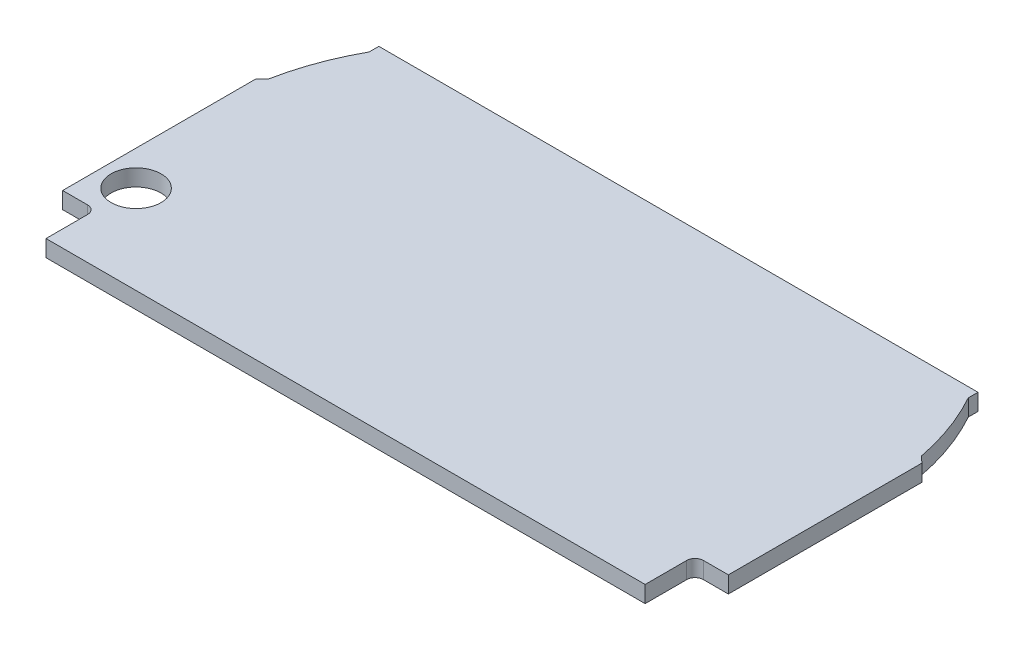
ISO-10303-21;
HEADER;
FILE_DESCRIPTION(('STEP AP214'),'2;1');
FILE_NAME('part.step','',(''),(''),'','','');
FILE_SCHEMA(('AUTOMOTIVE_DESIGN { 1 0 10303 214 1 1 1 1 }'));
ENDSEC;
DATA;
#1=APPLICATION_CONTEXT('core data for automotive mechanical design processes');
#2=APPLICATION_PROTOCOL_DEFINITION('international standard','automotive_design',2000,#1);
#3=PRODUCT_CONTEXT('',#1,'mechanical');
#4=PRODUCT('Part','Part','',(#3));
#5=PRODUCT_RELATED_PRODUCT_CATEGORY('part','',(#4));
#6=PRODUCT_DEFINITION_FORMATION('','',#4);
#7=PRODUCT_DEFINITION_CONTEXT('part definition',#1,'design');
#8=PRODUCT_DEFINITION('design','',#6,#7);
#9=PRODUCT_DEFINITION_SHAPE('','',#8);
#10=(LENGTH_UNIT() NAMED_UNIT(*) SI_UNIT(.MILLI.,.METRE.));
#11=(NAMED_UNIT(*) PLANE_ANGLE_UNIT() SI_UNIT($,.RADIAN.));
#12=(NAMED_UNIT(*) SI_UNIT($,.STERADIAN.) SOLID_ANGLE_UNIT());
#13=UNCERTAINTY_MEASURE_WITH_UNIT(LENGTH_MEASURE(1.E-05),#10,'distance_accuracy_value','');
#14=(GEOMETRIC_REPRESENTATION_CONTEXT(3) GLOBAL_UNCERTAINTY_ASSIGNED_CONTEXT((#13)) GLOBAL_UNIT_ASSIGNED_CONTEXT((#10,
#11,#12)) REPRESENTATION_CONTEXT('',''));
#15=CARTESIAN_POINT('',(0.,0.,0.));
#16=DIRECTION('',(0.,0.,1.));
#17=DIRECTION('',(1.,0.,0.));
#18=AXIS2_PLACEMENT_3D('',#15,#16,#17);
#19=CARTESIAN_POINT('',(19.5581651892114,1.,-30.2431440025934));
#20=DIRECTION('',(0.,-1.,0.));
#21=DIRECTION('',(0.,0.,-1.));
#22=AXIS2_PLACEMENT_3D('',#19,#20,#21);
#23=CYLINDRICAL_SURFACE('',#22,15.);
#24=CARTESIAN_POINT('',(19.5581651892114,0.,-30.2431440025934));
#25=DIRECTION('',(0.,1.,0.));
#26=DIRECTION('',(0.,0.,1.));
#27=AXIS2_PLACEMENT_3D('',#24,#25,#26);
#28=CIRCLE('',#27,15.);
#29=CARTESIAN_POINT('',(4.83663293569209,0.,-33.1200326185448));
#30=VERTEX_POINT('',#29);
#31=CARTESIAN_POINT('',(6.45015274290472,0.,-37.5356065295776));
#32=VERTEX_POINT('',#31);
#33=EDGE_CURVE('E168',#30,#32,#28,.F.);
#34=ORIENTED_EDGE('',*,*,#33,.F.);
#35=DIRECTION('',(0.,-1.,0.));
#36=VECTOR('',#35,1.);
#37=CARTESIAN_POINT('',(4.83663293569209,1.,-33.1200326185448));
#38=LINE('',#37,#36);
#39=CARTESIAN_POINT('',(4.83663293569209,1.,-33.1200326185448));
#40=VERTEX_POINT('',#39);
#41=EDGE_CURVE('E11',#40,#30,#38,.T.);
#42=ORIENTED_EDGE('',*,*,#41,.F.);
#43=CARTESIAN_POINT('',(19.5581651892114,1.,-30.2431440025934));
#44=DIRECTION('',(0.,1.,0.));
#45=DIRECTION('',(0.,0.,1.));
#46=AXIS2_PLACEMENT_3D('',#43,#44,#45);
#47=CIRCLE('',#46,15.);
#48=CARTESIAN_POINT('',(6.45015274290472,1.,-37.5356065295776));
#49=VERTEX_POINT('',#48);
#50=EDGE_CURVE('E228',#40,#49,#47,.F.);
#51=ORIENTED_EDGE('',*,*,#50,.T.);
#52=DIRECTION('',(0.,-1.,0.));
#53=VECTOR('',#52,1.);
#54=CARTESIAN_POINT('',(6.45015274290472,1.,-37.5356065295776));
#55=LINE('',#54,#53);
#56=EDGE_CURVE('E92',#49,#32,#55,.T.);
#57=ORIENTED_EDGE('',*,*,#56,.T.);
#58=EDGE_LOOP('',(#34,#42,#51,#57));
#59=FACE_BOUND('',#58,.T.);
#60=ADVANCED_FACE('F17',(#59),#23,.T.);
#61=CARTESIAN_POINT('',(-14.196751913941,1.,-14.5545494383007));
#62=DIRECTION('',(-0.698253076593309,0.,-0.715850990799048));
#63=DIRECTION('',(-0.715850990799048,0.,0.698253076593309));
#64=AXIS2_PLACEMENT_3D('',#61,#62,#63);
#65=PLANE('',#64);
#66=DIRECTION('',(0.715850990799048,0.,-0.698253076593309));
#67=VECTOR('',#66,1.);
#68=CARTESIAN_POINT('',(-14.196751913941,0.,-14.5545494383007));
#69=LINE('',#68,#67);
#70=CARTESIAN_POINT('',(4.45015274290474,0.,-32.7430533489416));
#71=VERTEX_POINT('',#70);
#72=EDGE_CURVE('E172',#71,#30,#69,.T.);
#73=ORIENTED_EDGE('',*,*,#72,.F.);
#74=DIRECTION('',(0.,-1.,0.));
#75=VECTOR('',#74,1.);
#76=CARTESIAN_POINT('',(4.45015274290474,1.,-32.7430533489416));
#77=LINE('',#76,#75);
#78=CARTESIAN_POINT('',(4.45015274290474,1.,-32.7430533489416));
#79=VERTEX_POINT('',#78);
#80=EDGE_CURVE('E26',#79,#71,#77,.T.);
#81=ORIENTED_EDGE('',*,*,#80,.F.);
#82=DIRECTION('',(0.715850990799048,0.,-0.698253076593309));
#83=VECTOR('',#82,1.);
#84=CARTESIAN_POINT('',(-14.196751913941,1.,-14.5545494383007));
#85=LINE('',#84,#83);
#86=EDGE_CURVE('E284',#79,#40,#85,.T.);
#87=ORIENTED_EDGE('',*,*,#86,.T.);
#88=ORIENTED_EDGE('',*,*,#41,.T.);
#89=EDGE_LOOP('',(#73,#81,#87,#88));
#90=FACE_BOUND('',#89,.T.);
#91=ADVANCED_FACE('F283',(#90),#65,.T.);
#92=CARTESIAN_POINT('',(4.45015274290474,1.,0.));
#93=DIRECTION('',(1.,0.,0.));
#94=DIRECTION('',(0.,0.,-1.));
#95=AXIS2_PLACEMENT_3D('',#92,#93,#94);
#96=PLANE('',#95);
#97=DIRECTION('',(0.,0.,1.));
#98=VECTOR('',#97,1.);
#99=CARTESIAN_POINT('',(4.45015274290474,0.,0.));
#100=LINE('',#99,#98);
#101=CARTESIAN_POINT('',(4.45015274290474,0.,-21.1200326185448));
#102=VERTEX_POINT('',#101);
#103=EDGE_CURVE('E176',#71,#102,#100,.T.);
#104=ORIENTED_EDGE('',*,*,#103,.T.);
#105=DIRECTION('',(0.,-1.,0.));
#106=VECTOR('',#105,1.);
#107=CARTESIAN_POINT('',(4.45015274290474,1.,-21.1200326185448));
#108=LINE('',#107,#106);
#109=CARTESIAN_POINT('',(4.45015274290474,1.,-21.1200326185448));
#110=VERTEX_POINT('',#109);
#111=EDGE_CURVE('E265',#110,#102,#108,.T.);
#112=ORIENTED_EDGE('',*,*,#111,.F.);
#113=DIRECTION('',(0.,0.,1.));
#114=VECTOR('',#113,1.);
#115=CARTESIAN_POINT('',(4.45015274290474,1.,0.));
#116=LINE('',#115,#114);
#117=EDGE_CURVE('E274',#79,#110,#116,.T.);
#118=ORIENTED_EDGE('',*,*,#117,.F.);
#119=ORIENTED_EDGE('',*,*,#80,.T.);
#120=EDGE_LOOP('',(#104,#112,#118,#119));
#121=FACE_BOUND('',#120,.T.);
#122=ADVANCED_FACE('F272',(#121),#96,.F.);
#123=CARTESIAN_POINT('',(0.,1.,-21.1200326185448));
#124=DIRECTION('',(0.,0.,-1.));
#125=DIRECTION('',(-1.,0.,0.));
#126=AXIS2_PLACEMENT_3D('',#123,#124,#125);
#127=PLANE('',#126);
#128=DIRECTION('',(1.,0.,0.));
#129=VECTOR('',#128,1.);
#130=CARTESIAN_POINT('',(0.,0.,-21.1200326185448));
#131=LINE('',#130,#129);
#132=CARTESIAN_POINT('',(5.95015274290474,0.,-21.1200326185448));
#133=VERTEX_POINT('',#132);
#134=EDGE_CURVE('E179',#102,#133,#131,.T.);
#135=ORIENTED_EDGE('',*,*,#134,.T.);
#136=DIRECTION('',(0.,-1.,0.));
#137=VECTOR('',#136,1.);
#138=CARTESIAN_POINT('',(5.95015274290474,1.,-21.1200326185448));
#139=LINE('',#138,#137);
#140=CARTESIAN_POINT('',(5.95015274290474,1.,-21.1200326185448));
#141=VERTEX_POINT('',#140);
#142=EDGE_CURVE('E262',#141,#133,#139,.T.);
#143=ORIENTED_EDGE('',*,*,#142,.F.);
#144=DIRECTION('',(1.,0.,0.));
#145=VECTOR('',#144,1.);
#146=CARTESIAN_POINT('',(0.,1.,-21.1200326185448));
#147=LINE('',#146,#145);
#148=EDGE_CURVE('E293',#110,#141,#147,.T.);
#149=ORIENTED_EDGE('',*,*,#148,.F.);
#150=ORIENTED_EDGE('',*,*,#111,.T.);
#151=EDGE_LOOP('',(#135,#143,#149,#150));
#152=FACE_BOUND('',#151,.T.);
#153=ADVANCED_FACE('F368',(#152),#127,.F.);
#154=CARTESIAN_POINT('',(5.95015274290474,1.,-20.6200326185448));
#155=DIRECTION('',(0.,-1.,0.));
#156=DIRECTION('',(0.,0.,-1.));
#157=AXIS2_PLACEMENT_3D('',#154,#155,#156);
#158=CYLINDRICAL_SURFACE('',#157,0.5);
#159=CARTESIAN_POINT('',(5.95015274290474,0.,-20.6200326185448));
#160=DIRECTION('',(0.,1.,0.));
#161=DIRECTION('',(0.,0.,1.));
#162=AXIS2_PLACEMENT_3D('',#159,#160,#161);
#163=CIRCLE('',#162,0.5);
#164=CARTESIAN_POINT('',(6.45015274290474,0.,-20.6200326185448));
#165=VERTEX_POINT('',#164);
#166=EDGE_CURVE('E183',#165,#133,#163,.T.);
#167=ORIENTED_EDGE('',*,*,#166,.F.);
#168=DIRECTION('',(0.,-1.,0.));
#169=VECTOR('',#168,1.);
#170=CARTESIAN_POINT('',(6.45015274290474,1.,-20.6200326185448));
#171=LINE('',#170,#169);
#172=CARTESIAN_POINT('',(6.45015274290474,1.,-20.6200326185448));
#173=VERTEX_POINT('',#172);
#174=EDGE_CURVE('E259',#173,#165,#171,.T.);
#175=ORIENTED_EDGE('',*,*,#174,.F.);
#176=CARTESIAN_POINT('',(5.95015274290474,1.,-20.6200326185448));
#177=DIRECTION('',(0.,1.,0.));
#178=DIRECTION('',(0.,0.,1.));
#179=AXIS2_PLACEMENT_3D('',#176,#177,#178);
#180=CIRCLE('',#179,0.5);
#181=EDGE_CURVE('E296',#173,#141,#180,.T.);
#182=ORIENTED_EDGE('',*,*,#181,.T.);
#183=ORIENTED_EDGE('',*,*,#142,.T.);
#184=EDGE_LOOP('',(#167,#175,#182,#183));
#185=FACE_BOUND('',#184,.T.);
#186=ADVANCED_FACE('F364',(#185),#158,.F.);
#187=CARTESIAN_POINT('',(6.45015274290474,1.,0.));
#188=DIRECTION('',(-1.,0.,0.));
#189=DIRECTION('',(0.,0.,1.));
#190=AXIS2_PLACEMENT_3D('',#187,#188,#189);
#191=PLANE('',#190);
#192=DIRECTION('',(0.,0.,-1.));
#193=VECTOR('',#192,1.);
#194=CARTESIAN_POINT('',(6.45015274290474,0.,0.));
#195=LINE('',#194,#193);
#196=CARTESIAN_POINT('',(6.45015274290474,0.,-18.1200326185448));
#197=VERTEX_POINT('',#196);
#198=EDGE_CURVE('E187',#197,#165,#195,.T.);
#199=ORIENTED_EDGE('',*,*,#198,.F.);
#200=DIRECTION('',(0.,-1.,0.));
#201=VECTOR('',#200,1.);
#202=CARTESIAN_POINT('',(6.45015274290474,1.,-18.1200326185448));
#203=LINE('',#202,#201);
#204=CARTESIAN_POINT('',(6.45015274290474,1.,-18.1200326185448));
#205=VERTEX_POINT('',#204);
#206=EDGE_CURVE('E256',#205,#197,#203,.T.);
#207=ORIENTED_EDGE('',*,*,#206,.F.);
#208=DIRECTION('',(0.,0.,-1.));
#209=VECTOR('',#208,1.);
#210=CARTESIAN_POINT('',(6.45015274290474,1.,0.));
#211=LINE('',#210,#209);
#212=EDGE_CURVE('E300',#205,#173,#211,.T.);
#213=ORIENTED_EDGE('',*,*,#212,.T.);
#214=ORIENTED_EDGE('',*,*,#174,.T.);
#215=EDGE_LOOP('',(#199,#207,#213,#214));
#216=FACE_BOUND('',#215,.T.);
#217=ADVANCED_FACE('F360',(#216),#191,.T.);
#218=CARTESIAN_POINT('',(0.,1.,-18.1200326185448));
#219=DIRECTION('',(0.,0.,-1.));
#220=DIRECTION('',(-1.,0.,0.));
#221=AXIS2_PLACEMENT_3D('',#218,#219,#220);
#222=PLANE('',#221);
#223=DIRECTION('',(1.,0.,0.));
#224=VECTOR('',#223,1.);
#225=CARTESIAN_POINT('',(0.,0.,-18.1200326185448));
#226=LINE('',#225,#224);
#227=CARTESIAN_POINT('',(42.4501527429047,0.,-18.1200326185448));
#228=VERTEX_POINT('',#227);
#229=EDGE_CURVE('E191',#197,#228,#226,.T.);
#230=ORIENTED_EDGE('',*,*,#229,.T.);
#231=DIRECTION('',(0.,-1.,0.));
#232=VECTOR('',#231,1.);
#233=CARTESIAN_POINT('',(42.4501527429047,1.,-18.1200326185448));
#234=LINE('',#233,#232);
#235=CARTESIAN_POINT('',(42.4501527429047,1.,-18.1200326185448));
#236=VERTEX_POINT('',#235);
#237=EDGE_CURVE('E252',#236,#228,#234,.T.);
#238=ORIENTED_EDGE('',*,*,#237,.F.);
#239=DIRECTION('',(1.,0.,0.));
#240=VECTOR('',#239,1.);
#241=CARTESIAN_POINT('',(0.,1.,-18.1200326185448));
#242=LINE('',#241,#240);
#243=EDGE_CURVE('E304',#205,#236,#242,.T.);
#244=ORIENTED_EDGE('',*,*,#243,.F.);
#245=ORIENTED_EDGE('',*,*,#206,.T.);
#246=EDGE_LOOP('',(#230,#238,#244,#245));
#247=FACE_BOUND('',#246,.T.);
#248=ADVANCED_FACE('F356',(#247),#222,.F.);
#249=CARTESIAN_POINT('',(42.4501527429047,1.,0.));
#250=DIRECTION('',(-1.,0.,0.));
#251=DIRECTION('',(0.,0.,1.));
#252=AXIS2_PLACEMENT_3D('',#249,#250,#251);
#253=PLANE('',#252);
#254=DIRECTION('',(0.,0.,-1.));
#255=VECTOR('',#254,1.);
#256=CARTESIAN_POINT('',(42.4501527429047,0.,0.));
#257=LINE('',#256,#255);
#258=CARTESIAN_POINT('',(42.4501527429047,0.,-20.6200326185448));
#259=VERTEX_POINT('',#258);
#260=EDGE_CURVE('E194',#228,#259,#257,.T.);
#261=ORIENTED_EDGE('',*,*,#260,.T.);
#262=DIRECTION('',(0.,-1.,0.));
#263=VECTOR('',#262,1.);
#264=CARTESIAN_POINT('',(42.4501527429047,1.,-20.6200326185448));
#265=LINE('',#264,#263);
#266=CARTESIAN_POINT('',(42.4501527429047,1.,-20.6200326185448));
#267=VERTEX_POINT('',#266);
#268=EDGE_CURVE('E248',#267,#259,#265,.T.);
#269=ORIENTED_EDGE('',*,*,#268,.F.);
#270=DIRECTION('',(0.,0.,-1.));
#271=VECTOR('',#270,1.);
#272=CARTESIAN_POINT('',(42.4501527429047,1.,0.));
#273=LINE('',#272,#271);
#274=EDGE_CURVE('E307',#236,#267,#273,.T.);
#275=ORIENTED_EDGE('',*,*,#274,.F.);
#276=ORIENTED_EDGE('',*,*,#237,.T.);
#277=EDGE_LOOP('',(#261,#269,#275,#276));
#278=FACE_BOUND('',#277,.T.);
#279=ADVANCED_FACE('F352',(#278),#253,.F.);
#280=CARTESIAN_POINT('',(42.9501527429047,1.,-20.6200326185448));
#281=DIRECTION('',(0.,-1.,0.));
#282=DIRECTION('',(0.,0.,-1.));
#283=AXIS2_PLACEMENT_3D('',#280,#281,#282);
#284=CYLINDRICAL_SURFACE('',#283,0.5);
#285=CARTESIAN_POINT('',(42.9501527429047,0.,-20.6200326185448));
#286=DIRECTION('',(0.,1.,0.));
#287=DIRECTION('',(0.,0.,1.));
#288=AXIS2_PLACEMENT_3D('',#285,#286,#287);
#289=CIRCLE('',#288,0.5);
#290=CARTESIAN_POINT('',(42.9501527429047,0.,-21.1200326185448));
#291=VERTEX_POINT('',#290);
#292=EDGE_CURVE('E197',#259,#291,#289,.F.);
#293=ORIENTED_EDGE('',*,*,#292,.T.);
#294=DIRECTION('',(0.,-1.,0.));
#295=VECTOR('',#294,1.);
#296=CARTESIAN_POINT('',(42.9501527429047,1.,-21.1200326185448));
#297=LINE('',#296,#295);
#298=CARTESIAN_POINT('',(42.9501527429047,1.,-21.1200326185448));
#299=VERTEX_POINT('',#298);
#300=EDGE_CURVE('E245',#299,#291,#297,.T.);
#301=ORIENTED_EDGE('',*,*,#300,.F.);
#302=CARTESIAN_POINT('',(42.9501527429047,1.,-20.6200326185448));
#303=DIRECTION('',(0.,1.,0.));
#304=DIRECTION('',(0.,0.,1.));
#305=AXIS2_PLACEMENT_3D('',#302,#303,#304);
#306=CIRCLE('',#305,0.5);
#307=EDGE_CURVE('E310',#267,#299,#306,.F.);
#308=ORIENTED_EDGE('',*,*,#307,.F.);
#309=ORIENTED_EDGE('',*,*,#268,.T.);
#310=EDGE_LOOP('',(#293,#301,#308,#309));
#311=FACE_BOUND('',#310,.T.);
#312=ADVANCED_FACE('F347',(#311),#284,.F.);
#313=CARTESIAN_POINT('',(0.,1.,-21.1200326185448));
#314=DIRECTION('',(0.,0.,1.));
#315=DIRECTION('',(1.,0.,0.));
#316=AXIS2_PLACEMENT_3D('',#313,#314,#315);
#317=PLANE('',#316);
#318=DIRECTION('',(-1.,0.,0.));
#319=VECTOR('',#318,1.);
#320=CARTESIAN_POINT('',(0.,0.,-21.1200326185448));
#321=LINE('',#320,#319);
#322=CARTESIAN_POINT('',(44.4501527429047,0.,-21.1200326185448));
#323=VERTEX_POINT('',#322);
#324=EDGE_CURVE('E201',#323,#291,#321,.T.);
#325=ORIENTED_EDGE('',*,*,#324,.F.);
#326=DIRECTION('',(0.,-1.,0.));
#327=VECTOR('',#326,1.);
#328=CARTESIAN_POINT('',(44.4501527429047,1.,-21.1200326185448));
#329=LINE('',#328,#327);
#330=CARTESIAN_POINT('',(44.4501527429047,1.,-21.1200326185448));
#331=VERTEX_POINT('',#330);
#332=EDGE_CURVE('E242',#331,#323,#329,.T.);
#333=ORIENTED_EDGE('',*,*,#332,.F.);
#334=DIRECTION('',(-1.,0.,0.));
#335=VECTOR('',#334,1.);
#336=CARTESIAN_POINT('',(0.,1.,-21.1200326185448));
#337=LINE('',#336,#335);
#338=EDGE_CURVE('E313',#331,#299,#337,.T.);
#339=ORIENTED_EDGE('',*,*,#338,.T.);
#340=ORIENTED_EDGE('',*,*,#300,.T.);
#341=EDGE_LOOP('',(#325,#333,#339,#340));
#342=FACE_BOUND('',#341,.T.);
#343=ADVANCED_FACE('F341',(#342),#317,.T.);
#344=CARTESIAN_POINT('',(44.4501527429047,1.,0.));
#345=DIRECTION('',(1.,0.,0.));
#346=DIRECTION('',(0.,0.,-1.));
#347=AXIS2_PLACEMENT_3D('',#344,#345,#346);
#348=PLANE('',#347);
#349=DIRECTION('',(0.,0.,1.));
#350=VECTOR('',#349,1.);
#351=CARTESIAN_POINT('',(44.4501527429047,0.,0.));
#352=LINE('',#351,#350);
#353=CARTESIAN_POINT('',(44.4501527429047,0.,-32.7430533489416));
#354=VERTEX_POINT('',#353);
#355=EDGE_CURVE('E205',#354,#323,#352,.T.);
#356=ORIENTED_EDGE('',*,*,#355,.F.);
#357=DIRECTION('',(0.,-1.,0.));
#358=VECTOR('',#357,1.);
#359=CARTESIAN_POINT('',(44.4501527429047,1.,-32.7430533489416));
#360=LINE('',#359,#358);
#361=CARTESIAN_POINT('',(44.4501527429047,1.,-32.7430533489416));
#362=VERTEX_POINT('',#361);
#363=EDGE_CURVE('E239',#362,#354,#360,.T.);
#364=ORIENTED_EDGE('',*,*,#363,.F.);
#365=DIRECTION('',(0.,0.,1.));
#366=VECTOR('',#365,1.);
#367=CARTESIAN_POINT('',(44.4501527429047,1.,0.));
#368=LINE('',#367,#366);
#369=EDGE_CURVE('E317',#362,#331,#368,.T.);
#370=ORIENTED_EDGE('',*,*,#369,.T.);
#371=ORIENTED_EDGE('',*,*,#332,.T.);
#372=EDGE_LOOP('',(#356,#364,#370,#371));
#373=FACE_BOUND('',#372,.T.);
#374=ADVANCED_FACE('F338',(#373),#348,.T.);
#375=CARTESIAN_POINT('',(38.0384557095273,1.,-38.9971302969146));
#376=DIRECTION('',(-0.698253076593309,0.,0.715850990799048));
#377=DIRECTION('',(0.715850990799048,0.,0.698253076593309));
#378=AXIS2_PLACEMENT_3D('',#375,#376,#377);
#379=PLANE('',#378);
#380=DIRECTION('',(-0.715850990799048,0.,-0.698253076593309));
#381=VECTOR('',#380,1.);
#382=CARTESIAN_POINT('',(38.0384557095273,0.,-38.9971302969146));
#383=LINE('',#382,#381);
#384=CARTESIAN_POINT('',(44.0636725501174,0.,-33.1200326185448));
#385=VERTEX_POINT('',#384);
#386=EDGE_CURVE('E209',#354,#385,#383,.T.);
#387=ORIENTED_EDGE('',*,*,#386,.T.);
#388=DIRECTION('',(0.,-1.,0.));
#389=VECTOR('',#388,1.);
#390=CARTESIAN_POINT('',(44.0636725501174,1.,-33.1200326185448));
#391=LINE('',#390,#389);
#392=CARTESIAN_POINT('',(44.0636725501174,1.,-33.1200326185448));
#393=VERTEX_POINT('',#392);
#394=EDGE_CURVE('E235',#393,#385,#391,.T.);
#395=ORIENTED_EDGE('',*,*,#394,.F.);
#396=DIRECTION('',(-0.715850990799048,0.,-0.698253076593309));
#397=VECTOR('',#396,1.);
#398=CARTESIAN_POINT('',(38.0384557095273,1.,-38.9971302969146));
#399=LINE('',#398,#397);
#400=EDGE_CURVE('E321',#362,#393,#399,.T.);
#401=ORIENTED_EDGE('',*,*,#400,.F.);
#402=ORIENTED_EDGE('',*,*,#363,.T.);
#403=EDGE_LOOP('',(#387,#395,#401,#402));
#404=FACE_BOUND('',#403,.T.);
#405=ADVANCED_FACE('F331',(#404),#379,.F.);
#406=CARTESIAN_POINT('',(29.3421402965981,1.,-30.2431440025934));
#407=DIRECTION('',(0.,-1.,0.));
#408=DIRECTION('',(0.,0.,-1.));
#409=AXIS2_PLACEMENT_3D('',#406,#407,#408);
#410=CYLINDRICAL_SURFACE('',#409,15.);
#411=CARTESIAN_POINT('',(29.3421402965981,0.,-30.2431440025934));
#412=DIRECTION('',(0.,1.,0.));
#413=DIRECTION('',(0.,0.,1.));
#414=AXIS2_PLACEMENT_3D('',#411,#412,#413);
#415=CIRCLE('',#414,15.);
#416=CARTESIAN_POINT('',(42.4501527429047,0.,-37.5356065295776));
#417=VERTEX_POINT('',#416);
#418=EDGE_CURVE('E212',#385,#417,#415,.T.);
#419=ORIENTED_EDGE('',*,*,#418,.T.);
#420=DIRECTION('',(0.,-1.,0.));
#421=VECTOR('',#420,1.);
#422=CARTESIAN_POINT('',(42.4501527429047,1.,-37.5356065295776));
#423=LINE('',#422,#421);
#424=CARTESIAN_POINT('',(42.4501527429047,1.,-37.5356065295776));
#425=VERTEX_POINT('',#424);
#426=EDGE_CURVE('E146',#425,#417,#423,.T.);
#427=ORIENTED_EDGE('',*,*,#426,.F.);
#428=CARTESIAN_POINT('',(29.3421402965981,1.,-30.2431440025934));
#429=DIRECTION('',(0.,1.,0.));
#430=DIRECTION('',(0.,0.,1.));
#431=AXIS2_PLACEMENT_3D('',#428,#429,#430);
#432=CIRCLE('',#431,15.);
#433=EDGE_CURVE('E152',#393,#425,#432,.T.);
#434=ORIENTED_EDGE('',*,*,#433,.F.);
#435=ORIENTED_EDGE('',*,*,#394,.T.);
#436=EDGE_LOOP('',(#419,#427,#434,#435));
#437=FACE_BOUND('',#436,.T.);
#438=ADVANCED_FACE('F335',(#437),#410,.T.);
#439=CARTESIAN_POINT('',(42.4501527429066,1.,-2.01604351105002E-12));
#440=DIRECTION('',(1.,0.,0.));
#441=DIRECTION('',(0.,0.,-1.));
#442=AXIS2_PLACEMENT_3D('',#439,#440,#441);
#443=PLANE('',#442);
#444=DIRECTION('',(0.,0.,1.));
#445=VECTOR('',#444,1.);
#446=CARTESIAN_POINT('',(42.4501527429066,0.,-2.01604351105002E-12));
#447=LINE('',#446,#445);
#448=CARTESIAN_POINT('',(42.4501527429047,0.,-38.1200326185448));
#449=VERTEX_POINT('',#448);
#450=EDGE_CURVE('E140',#449,#417,#447,.T.);
#451=ORIENTED_EDGE('',*,*,#450,.F.);
#452=DIRECTION('',(0.,-1.,0.));
#453=VECTOR('',#452,1.);
#454=CARTESIAN_POINT('',(42.4501527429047,1.,-38.1200326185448));
#455=LINE('',#454,#453);
#456=CARTESIAN_POINT('',(42.4501527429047,1.,-38.1200326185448));
#457=VERTEX_POINT('',#456);
#458=EDGE_CURVE('E135',#457,#449,#455,.T.);
#459=ORIENTED_EDGE('',*,*,#458,.F.);
#460=DIRECTION('',(0.,0.,1.));
#461=VECTOR('',#460,1.);
#462=CARTESIAN_POINT('',(42.4501527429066,1.,-2.01604351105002E-12));
#463=LINE('',#462,#461);
#464=EDGE_CURVE('E138',#457,#425,#463,.T.);
#465=ORIENTED_EDGE('',*,*,#464,.T.);
#466=ORIENTED_EDGE('',*,*,#426,.T.);
#467=EDGE_LOOP('',(#451,#459,#465,#466));
#468=FACE_BOUND('',#467,.T.);
#469=ADVANCED_FACE('F137',(#468),#443,.T.);
#470=CARTESIAN_POINT('',(0.,1.,-38.1200326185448));
#471=DIRECTION('',(0.,0.,-1.));
#472=DIRECTION('',(-1.,0.,0.));
#473=AXIS2_PLACEMENT_3D('',#470,#471,#472);
#474=PLANE('',#473);
#475=DIRECTION('',(1.,0.,0.));
#476=VECTOR('',#475,1.);
#477=CARTESIAN_POINT('',(0.,0.,-38.1200326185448));
#478=LINE('',#477,#476);
#479=CARTESIAN_POINT('',(6.45015274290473,0.,-38.1200326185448));
#480=VERTEX_POINT('',#479);
#481=EDGE_CURVE('E218',#480,#449,#478,.T.);
#482=ORIENTED_EDGE('',*,*,#481,.F.);
#483=DIRECTION('',(0.,-1.,0.));
#484=VECTOR('',#483,1.);
#485=CARTESIAN_POINT('',(6.45015274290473,1.,-38.1200326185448));
#486=LINE('',#485,#484);
#487=CARTESIAN_POINT('',(6.45015274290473,1.,-38.1200326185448));
#488=VERTEX_POINT('',#487);
#489=EDGE_CURVE('E85',#488,#480,#486,.T.);
#490=ORIENTED_EDGE('',*,*,#489,.F.);
#491=DIRECTION('',(1.,0.,0.));
#492=VECTOR('',#491,1.);
#493=CARTESIAN_POINT('',(0.,1.,-38.1200326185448));
#494=LINE('',#493,#492);
#495=EDGE_CURVE('E150',#488,#457,#494,.T.);
#496=ORIENTED_EDGE('',*,*,#495,.T.);
#497=ORIENTED_EDGE('',*,*,#458,.T.);
#498=EDGE_LOOP('',(#482,#490,#496,#497));
#499=FACE_BOUND('',#498,.T.);
#500=ADVANCED_FACE('F156',(#499),#474,.T.);
#501=CARTESIAN_POINT('',(6.45015274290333,1.,2.3932092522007E-13));
#502=DIRECTION('',(1.,0.,0.));
#503=DIRECTION('',(0.,0.,-1.));
#504=AXIS2_PLACEMENT_3D('',#501,#502,#503);
#505=PLANE('',#504);
#506=DIRECTION('',(0.,0.,1.));
#507=VECTOR('',#506,1.);
#508=CARTESIAN_POINT('',(6.45015274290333,0.,2.3932092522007E-13));
#509=LINE('',#508,#507);
#510=EDGE_CURVE('E221',#480,#32,#509,.T.);
#511=ORIENTED_EDGE('',*,*,#510,.T.);
#512=ORIENTED_EDGE('',*,*,#56,.F.);
#513=DIRECTION('',(0.,0.,1.));
#514=VECTOR('',#513,1.);
#515=CARTESIAN_POINT('',(6.45015274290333,1.,2.3932092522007E-13));
#516=LINE('',#515,#514);
#517=EDGE_CURVE('E34',#488,#49,#516,.T.);
#518=ORIENTED_EDGE('',*,*,#517,.F.);
#519=ORIENTED_EDGE('',*,*,#489,.T.);
#520=EDGE_LOOP('',(#511,#512,#518,#519));
#521=FACE_BOUND('',#520,.T.);
#522=ADVANCED_FACE('F285',(#521),#505,.F.);
#523=CARTESIAN_POINT('',(6.53784039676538,1.,-23.4447388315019));
#524=DIRECTION('',(0.,-1.,0.));
#525=DIRECTION('',(0.,0.,-1.));
#526=AXIS2_PLACEMENT_3D('',#523,#524,#525);
#527=CYLINDRICAL_SURFACE('',#526,1.5);
#528=CARTESIAN_POINT('',(6.53784039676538,1.,-23.4447388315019));
#529=DIRECTION('',(0.,1.,0.));
#530=DIRECTION('',(0.,0.,1.));
#531=AXIS2_PLACEMENT_3D('',#528,#529,#530);
#532=CIRCLE('',#531,1.5);
#533=CARTESIAN_POINT('',(6.53784039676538,1.,-21.9447388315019));
#534=VERTEX_POINT('',#533);
#535=EDGE_CURVE('E161',#534,#534,#532,.T.);
#536=ORIENTED_EDGE('',*,*,#535,.T.);
#537=EDGE_LOOP('',(#536));
#538=FACE_BOUND('',#537,.T.);
#539=CARTESIAN_POINT('',(6.53784039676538,0.,-23.4447388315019));
#540=DIRECTION('',(0.,1.,0.));
#541=DIRECTION('',(0.,0.,1.));
#542=AXIS2_PLACEMENT_3D('',#539,#540,#541);
#543=CIRCLE('',#542,1.5);
#544=CARTESIAN_POINT('',(6.53784039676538,0.,-21.9447388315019));
#545=VERTEX_POINT('',#544);
#546=EDGE_CURVE('E224',#545,#545,#543,.T.);
#547=ORIENTED_EDGE('',*,*,#546,.F.);
#548=EDGE_LOOP('',(#547));
#549=FACE_BOUND('',#548,.T.);
#550=ADVANCED_FACE('F495',(#538,#549),#527,.F.);
#551=CARTESIAN_POINT('',(0.,1.,0.));
#552=DIRECTION('',(0.,1.,0.));
#553=DIRECTION('',(0.,0.,1.));
#554=AXIS2_PLACEMENT_3D('',#551,#552,#553);
#555=PLANE('',#554);
#556=ORIENTED_EDGE('',*,*,#50,.F.);
#557=ORIENTED_EDGE('',*,*,#86,.F.);
#558=ORIENTED_EDGE('',*,*,#117,.T.);
#559=ORIENTED_EDGE('',*,*,#148,.T.);
#560=ORIENTED_EDGE('',*,*,#181,.F.);
#561=ORIENTED_EDGE('',*,*,#212,.F.);
#562=ORIENTED_EDGE('',*,*,#243,.T.);
#563=ORIENTED_EDGE('',*,*,#274,.T.);
#564=ORIENTED_EDGE('',*,*,#307,.T.);
#565=ORIENTED_EDGE('',*,*,#338,.F.);
#566=ORIENTED_EDGE('',*,*,#369,.F.);
#567=ORIENTED_EDGE('',*,*,#400,.T.);
#568=ORIENTED_EDGE('',*,*,#433,.T.);
#569=ORIENTED_EDGE('',*,*,#464,.F.);
#570=ORIENTED_EDGE('',*,*,#495,.F.);
#571=ORIENTED_EDGE('',*,*,#517,.T.);
#572=EDGE_LOOP('',(#556,#557,#558,#559,#560,#561,#562,#563,#564,#565,#566,#567,#568,#569,#570,#571));
#573=FACE_BOUND('',#572,.T.);
#574=ORIENTED_EDGE('',*,*,#535,.F.);
#575=EDGE_LOOP('',(#574));
#576=FACE_BOUND('',#575,.T.);
#577=ADVANCED_FACE('F148',(#573,#576),#555,.T.);
#578=CARTESIAN_POINT('',(0.,0.,0.));
#579=DIRECTION('',(0.,1.,0.));
#580=DIRECTION('',(0.,0.,1.));
#581=AXIS2_PLACEMENT_3D('',#578,#579,#580);
#582=PLANE('',#581);
#583=ORIENTED_EDGE('',*,*,#33,.T.);
#584=ORIENTED_EDGE('',*,*,#510,.F.);
#585=ORIENTED_EDGE('',*,*,#481,.T.);
#586=ORIENTED_EDGE('',*,*,#450,.T.);
#587=ORIENTED_EDGE('',*,*,#418,.F.);
#588=ORIENTED_EDGE('',*,*,#386,.F.);
#589=ORIENTED_EDGE('',*,*,#355,.T.);
#590=ORIENTED_EDGE('',*,*,#324,.T.);
#591=ORIENTED_EDGE('',*,*,#292,.F.);
#592=ORIENTED_EDGE('',*,*,#260,.F.);
#593=ORIENTED_EDGE('',*,*,#229,.F.);
#594=ORIENTED_EDGE('',*,*,#198,.T.);
#595=ORIENTED_EDGE('',*,*,#166,.T.);
#596=ORIENTED_EDGE('',*,*,#134,.F.);
#597=ORIENTED_EDGE('',*,*,#103,.F.);
#598=ORIENTED_EDGE('',*,*,#72,.T.);
#599=EDGE_LOOP('',(#583,#584,#585,#586,#587,#588,#589,#590,#591,#592,#593,#594,#595,#596,#597,#598));
#600=FACE_BOUND('',#599,.T.);
#601=ORIENTED_EDGE('',*,*,#546,.T.);
#602=EDGE_LOOP('',(#601));
#603=FACE_BOUND('',#602,.T.);
#604=ADVANCED_FACE('F281',(#600,#603),#582,.F.);
#605=CLOSED_SHELL('',(#60,#91,#122,#153,#186,#217,#248,#279,#312,#343,#374,#405,#438,#469,#500,
#522,#550,#577,#604));
#606=MANIFOLD_SOLID_BREP('B1',#605);
#607=ADVANCED_BREP_SHAPE_REPRESENTATION('',(#18,#606),#14);
#608=SHAPE_DEFINITION_REPRESENTATION(#9,#607);
ENDSEC;
END-ISO-10303-21;
